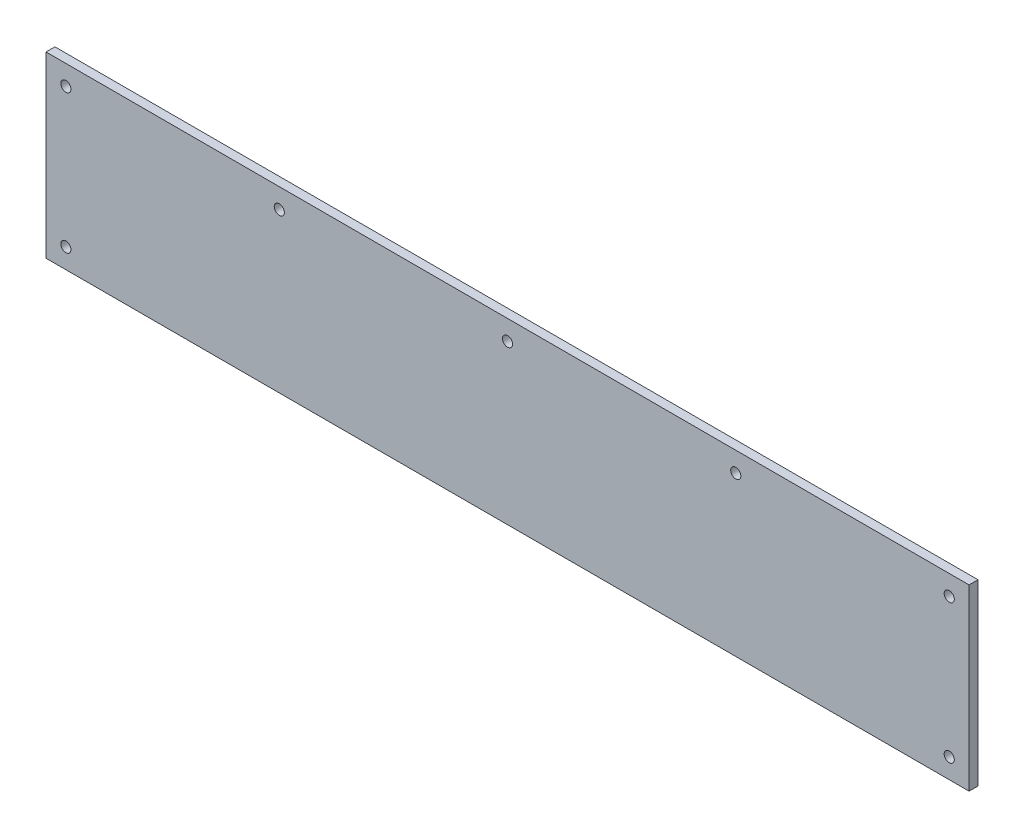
from build123d import *

# Parameters (mm, degrees)
SKETCH1_W           = 465
SKETCH1_H           = 90
SKETCH1_R           = 2.55
BOSS_EXTRUDE1_DEPTH = 2.2479


with BuildPart() as part:
    # Sketch1 → Boss-Extrude1 (new, symmetric)
    with BuildSketch(Plane.XY):
        Rectangle(SKETCH1_W, SKETCH1_H)
        with Locations((-222.5, 35)):
            Circle(SKETCH1_R, mode=Mode.SUBTRACT)
        with Locations((-222.5, -35)):
            Circle(SKETCH1_R, mode=Mode.SUBTRACT)
        with Locations((0, 35)):
            Circle(SKETCH1_R, mode=Mode.SUBTRACT)
        with Locations((-114.975, 35)):
            Circle(SKETCH1_R, mode=Mode.SUBTRACT)
        with Locations(Location((222.5, -35, 0), (0, 0, 180))):
            Circle(SKETCH1_R, mode=Mode.SUBTRACT)
        with Locations(Location((222.5, 35, 0), (0, 0, 180))):
            Circle(SKETCH1_R, mode=Mode.SUBTRACT)
        with Locations(Location((114.975, 35, 0), (0, 0, 180))):
            Circle(SKETCH1_R, mode=Mode.SUBTRACT)
    extrude(amount=BOSS_EXTRUDE1_DEPTH, both=True)


solid = part.part
